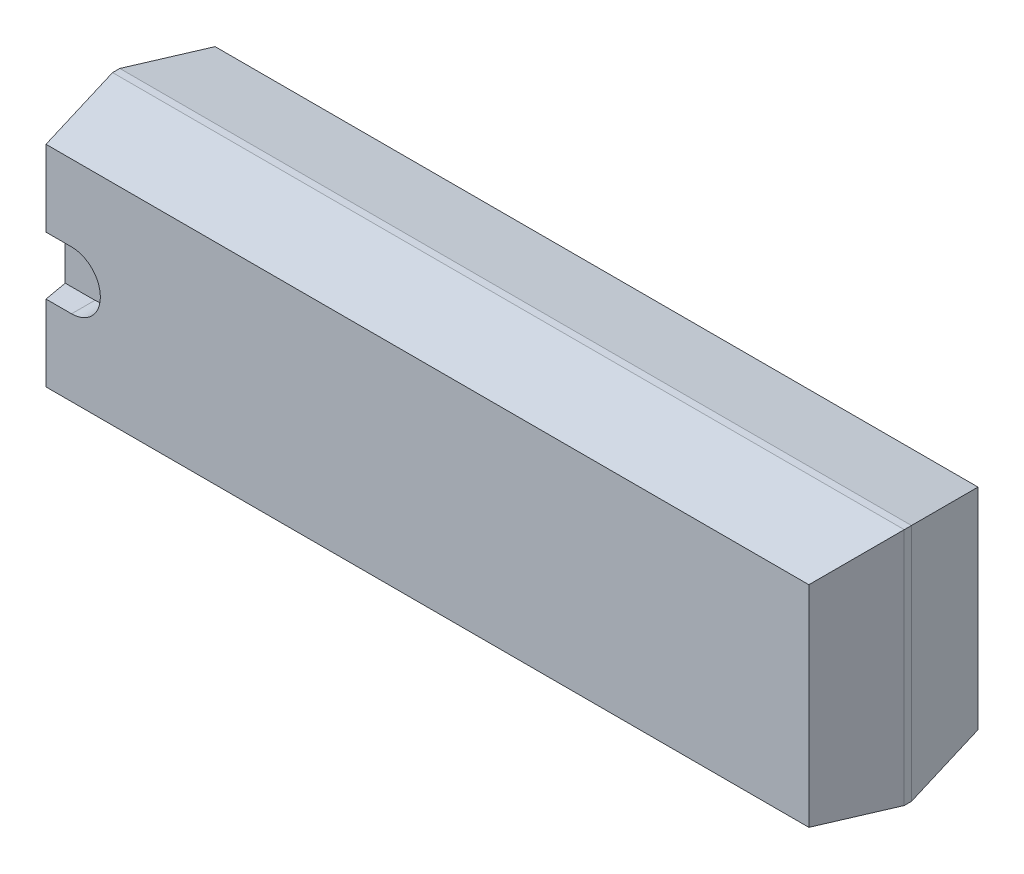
ISO-10303-21;
HEADER;
FILE_DESCRIPTION(('STEP AP214'),'2;1');
FILE_NAME('part.step','',(''),(''),'','','');
FILE_SCHEMA(('AUTOMOTIVE_DESIGN { 1 0 10303 214 1 1 1 1 }'));
ENDSEC;
DATA;
#1=APPLICATION_CONTEXT('core data for automotive mechanical design processes');
#2=APPLICATION_PROTOCOL_DEFINITION('international standard','automotive_design',2000,#1);
#3=PRODUCT_CONTEXT('',#1,'mechanical');
#4=PRODUCT('Part','Part','',(#3));
#5=PRODUCT_RELATED_PRODUCT_CATEGORY('part','',(#4));
#6=PRODUCT_DEFINITION_FORMATION('','',#4);
#7=PRODUCT_DEFINITION_CONTEXT('part definition',#1,'design');
#8=PRODUCT_DEFINITION('design','',#6,#7);
#9=PRODUCT_DEFINITION_SHAPE('','',#8);
#10=(LENGTH_UNIT() NAMED_UNIT(*) SI_UNIT(.MILLI.,.METRE.));
#11=(NAMED_UNIT(*) PLANE_ANGLE_UNIT() SI_UNIT($,.RADIAN.));
#12=(NAMED_UNIT(*) SI_UNIT($,.STERADIAN.) SOLID_ANGLE_UNIT());
#13=UNCERTAINTY_MEASURE_WITH_UNIT(LENGTH_MEASURE(1.E-05),#10,'distance_accuracy_value','');
#14=(GEOMETRIC_REPRESENTATION_CONTEXT(3) GLOBAL_UNCERTAINTY_ASSIGNED_CONTEXT((#13)) GLOBAL_UNIT_ASSIGNED_CONTEXT((#10,
#11,#12)) REPRESENTATION_CONTEXT('',''));
#15=CARTESIAN_POINT('',(0.,0.,0.));
#16=DIRECTION('',(0.,0.,1.));
#17=DIRECTION('',(1.,0.,0.));
#18=AXIS2_PLACEMENT_3D('',#15,#16,#17);
#19=CARTESIAN_POINT('',(-0.99999706,3.8050105,4.50000116));
#20=DIRECTION('',(0.,0.,1.));
#21=DIRECTION('',(1.,0.,0.));
#22=AXIS2_PLACEMENT_3D('',#19,#20,#21);
#23=CYLINDRICAL_SURFACE('',#22,0.8);
#24=CARTESIAN_POINT('',(-0.99999706,3.8050105,4.50000116));
#25=DIRECTION('',(0.,0.,1.));
#26=DIRECTION('',(1.,0.,0.));
#27=AXIS2_PLACEMENT_3D('',#24,#25,#26);
#28=CIRCLE('',#27,0.8);
#29=CARTESIAN_POINT('',(-0.19999706,3.8050105,4.50000116));
#30=VERTEX_POINT('',#29);
#31=CARTESIAN_POINT('',(-0.99999706,3.0050105,4.50000116));
#32=VERTEX_POINT('',#31);
#33=EDGE_CURVE('E142',#30,#32,#28,.F.);
#34=ORIENTED_EDGE('',*,*,#33,.T.);
#35=DIRECTION('',(0.,0.,1.));
#36=VECTOR('',#35,1.);
#37=CARTESIAN_POINT('',(-0.99999706,3.0050105,4.50000116));
#38=LINE('',#37,#36);
#39=CARTESIAN_POINT('',(-0.99999706,3.0050105,5.14999986));
#40=VERTEX_POINT('',#39);
#41=EDGE_CURVE('E126',#40,#32,#38,.F.);
#42=ORIENTED_EDGE('',*,*,#41,.F.);
#43=CARTESIAN_POINT('',(-0.99999706,3.8050105,5.14999986));
#44=DIRECTION('',(0.,0.,1.));
#45=DIRECTION('',(1.,0.,0.));
#46=AXIS2_PLACEMENT_3D('',#43,#44,#45);
#47=CIRCLE('',#46,0.8);
#48=CARTESIAN_POINT('',(-0.19999706,3.8050105,5.14999986));
#49=VERTEX_POINT('',#48);
#50=EDGE_CURVE('E158',#40,#49,#47,.T.);
#51=ORIENTED_EDGE('',*,*,#50,.T.);
#52=DIRECTION('',(0.,0.,1.));
#53=VECTOR('',#52,1.);
#54=CARTESIAN_POINT('',(-0.19999706,3.8050105,4.50000116));
#55=LINE('',#54,#53);
#56=EDGE_CURVE('E179',#30,#49,#55,.T.);
#57=ORIENTED_EDGE('',*,*,#56,.F.);
#58=EDGE_LOOP('',(#34,#42,#51,#57));
#59=FACE_BOUND('',#58,.T.);
#60=ADVANCED_FACE('F16',(#59),#23,.F.);
#61=CARTESIAN_POINT('',(-0.19999706,3.0050105,4.50000116));
#62=DIRECTION('',(-1.,0.,0.));
#63=DIRECTION('',(0.,0.,1.));
#64=AXIS2_PLACEMENT_3D('',#61,#62,#63);
#65=PLANE('',#64);
#66=DIRECTION('',(0.,0.,1.));
#67=VECTOR('',#66,1.);
#68=CARTESIAN_POINT('',(-0.19999706,3.81501236,4.50000116));
#69=LINE('',#68,#67);
#70=CARTESIAN_POINT('',(-0.19999706,3.81501236,5.14999986));
#71=VERTEX_POINT('',#70);
#72=CARTESIAN_POINT('',(-0.19999706,3.81501236,4.50000116));
#73=VERTEX_POINT('',#72);
#74=EDGE_CURVE('E177',#71,#73,#69,.F.);
#75=ORIENTED_EDGE('',*,*,#74,.T.);
#76=DIRECTION('',(0.,1.,0.));
#77=VECTOR('',#76,1.);
#78=CARTESIAN_POINT('',(-0.19999706,4.61501236,4.50000116));
#79=LINE('',#78,#77);
#80=EDGE_CURVE('E123',#73,#30,#79,.F.);
#81=ORIENTED_EDGE('',*,*,#80,.T.);
#82=ORIENTED_EDGE('',*,*,#56,.T.);
#83=DIRECTION('',(0.,1.,0.));
#84=VECTOR('',#83,1.);
#85=CARTESIAN_POINT('',(-0.19999706,7.13000606,5.14999986));
#86=LINE('',#85,#84);
#87=EDGE_CURVE('E157',#49,#71,#86,.T.);
#88=ORIENTED_EDGE('',*,*,#87,.T.);
#89=EDGE_LOOP('',(#75,#81,#82,#88));
#90=FACE_BOUND('',#89,.T.);
#91=ADVANCED_FACE('F224',(#90),#65,.T.);
#92=CARTESIAN_POINT('',(-0.99999706,3.81501236,4.50000116));
#93=DIRECTION('',(0.,0.,1.));
#94=DIRECTION('',(1.,0.,0.));
#95=AXIS2_PLACEMENT_3D('',#92,#93,#94);
#96=CYLINDRICAL_SURFACE('',#95,0.8);
#97=CARTESIAN_POINT('',(-0.99999706,3.81501236,4.50000116));
#98=DIRECTION('',(0.,0.,1.));
#99=DIRECTION('',(1.,0.,0.));
#100=AXIS2_PLACEMENT_3D('',#97,#98,#99);
#101=CIRCLE('',#100,0.8);
#102=CARTESIAN_POINT('',(-0.99999706,4.61501236,4.50000116));
#103=VERTEX_POINT('',#102);
#104=EDGE_CURVE('E19',#103,#73,#101,.F.);
#105=ORIENTED_EDGE('',*,*,#104,.T.);
#106=ORIENTED_EDGE('',*,*,#74,.F.);
#107=CARTESIAN_POINT('',(-0.99999706,3.81501236,5.14999986));
#108=DIRECTION('',(0.,0.,1.));
#109=DIRECTION('',(1.,0.,0.));
#110=AXIS2_PLACEMENT_3D('',#107,#108,#109);
#111=CIRCLE('',#110,0.8);
#112=CARTESIAN_POINT('',(-0.99999706,4.61501236,5.14999986));
#113=VERTEX_POINT('',#112);
#114=EDGE_CURVE('E131',#71,#113,#111,.T.);
#115=ORIENTED_EDGE('',*,*,#114,.T.);
#116=DIRECTION('',(0.,0.,-1.));
#117=VECTOR('',#116,1.);
#118=CARTESIAN_POINT('',(-0.99999706,4.61501236,4.50000116));
#119=LINE('',#118,#117);
#120=EDGE_CURVE('E128',#103,#113,#119,.F.);
#121=ORIENTED_EDGE('',*,*,#120,.F.);
#122=EDGE_LOOP('',(#105,#106,#115,#121));
#123=FACE_BOUND('',#122,.T.);
#124=ADVANCED_FACE('F129',(#123),#96,.F.);
#125=CARTESIAN_POINT('',(-2.40999772,3.0050105,4.50000116));
#126=DIRECTION('',(0.,1.,0.));
#127=DIRECTION('',(0.,0.,1.));
#128=AXIS2_PLACEMENT_3D('',#125,#126,#127);
#129=PLANE('',#128);
#130=ORIENTED_EDGE('',*,*,#41,.T.);
#131=DIRECTION('',(-1.,0.,0.));
#132=VECTOR('',#131,1.);
#133=CARTESIAN_POINT('',(-2.40999772,3.0050105,4.50000116));
#134=LINE('',#133,#132);
#135=CARTESIAN_POINT('',(-1.8255511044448,3.0050105,4.50000115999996));
#136=VERTEX_POINT('',#135);
#137=EDGE_CURVE('E140',#32,#136,#134,.T.);
#138=ORIENTED_EDGE('',*,*,#137,.T.);
#139=DIRECTION('',(0.175033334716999,0.,0.984562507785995));
#140=VECTOR('',#139,1.);
#141=CARTESIAN_POINT('',(-1.90999578,3.0050105,4.02499986));
#142=LINE('',#141,#140);
#143=CARTESIAN_POINT('',(-1.70999578,3.0050105,5.14999986));
#144=VERTEX_POINT('',#143);
#145=EDGE_CURVE('E152',#144,#136,#142,.F.);
#146=ORIENTED_EDGE('',*,*,#145,.F.);
#147=DIRECTION('',(-1.,0.,0.));
#148=VECTOR('',#147,1.);
#149=CARTESIAN_POINT('',(-2.10999578,3.0050105,5.14999986));
#150=LINE('',#149,#148);
#151=EDGE_CURVE('E134',#144,#40,#150,.F.);
#152=ORIENTED_EDGE('',*,*,#151,.T.);
#153=EDGE_LOOP('',(#130,#138,#146,#152));
#154=FACE_BOUND('',#153,.T.);
#155=ADVANCED_FACE('F218',(#154),#129,.T.);
#156=CARTESIAN_POINT('',(-2.40999772,4.61501236,4.50000116));
#157=DIRECTION('',(0.,0.,-1.));
#158=DIRECTION('',(-1.,0.,0.));
#159=AXIS2_PLACEMENT_3D('',#156,#157,#158);
#160=PLANE('',#159);
#161=ORIENTED_EDGE('',*,*,#33,.F.);
#162=ORIENTED_EDGE('',*,*,#80,.F.);
#163=ORIENTED_EDGE('',*,*,#104,.F.);
#164=DIRECTION('',(1.,0.,0.));
#165=VECTOR('',#164,1.);
#166=CARTESIAN_POINT('',(-0.19999706,4.61501236,4.50000116));
#167=LINE('',#166,#165);
#168=CARTESIAN_POINT('',(-1.82555110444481,4.61501236,4.50000115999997));
#169=VERTEX_POINT('',#168);
#170=EDGE_CURVE('E120',#169,#103,#167,.T.);
#171=ORIENTED_EDGE('',*,*,#170,.F.);
#172=DIRECTION('',(0.,1.,0.));
#173=VECTOR('',#172,1.);
#174=CARTESIAN_POINT('',(-1.8255511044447,6.73000606,4.50000115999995));
#175=LINE('',#174,#173);
#176=EDGE_CURVE('E150',#136,#169,#175,.T.);
#177=ORIENTED_EDGE('',*,*,#176,.F.);
#178=ORIENTED_EDGE('',*,*,#137,.F.);
#179=EDGE_LOOP('',(#161,#162,#163,#171,#177,#178));
#180=FACE_BOUND('',#179,.T.);
#181=ADVANCED_FACE('F117',(#180),#160,.F.);
#182=CARTESIAN_POINT('',(-0.19999706,4.61501236,4.50000116));
#183=DIRECTION('',(0.,-1.,0.));
#184=DIRECTION('',(0.,0.,-1.));
#185=AXIS2_PLACEMENT_3D('',#182,#183,#184);
#186=PLANE('',#185);
#187=ORIENTED_EDGE('',*,*,#120,.T.);
#188=DIRECTION('',(-1.,0.,0.));
#189=VECTOR('',#188,1.);
#190=CARTESIAN_POINT('',(-2.10999578,4.61501236,5.14999986));
#191=LINE('',#190,#189);
#192=CARTESIAN_POINT('',(-1.70999578,4.61501236,5.14999986));
#193=VERTEX_POINT('',#192);
#194=EDGE_CURVE('E156',#113,#193,#191,.T.);
#195=ORIENTED_EDGE('',*,*,#194,.T.);
#196=DIRECTION('',(0.175033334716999,0.,0.984562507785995));
#197=VECTOR('',#196,1.);
#198=CARTESIAN_POINT('',(-1.90999578,4.61501236,4.02499986));
#199=LINE('',#198,#197);
#200=EDGE_CURVE('E138',#169,#193,#199,.T.);
#201=ORIENTED_EDGE('',*,*,#200,.F.);
#202=ORIENTED_EDGE('',*,*,#170,.T.);
#203=EDGE_LOOP('',(#187,#195,#201,#202));
#204=FACE_BOUND('',#203,.T.);
#205=ADVANCED_FACE('F136',(#204),#186,.T.);
#206=CARTESIAN_POINT('',(-2.10999578,7.13000606,5.14999986));
#207=DIRECTION('',(0.,0.,-1.));
#208=DIRECTION('',(-1.,0.,0.));
#209=AXIS2_PLACEMENT_3D('',#206,#207,#208);
#210=PLANE('',#209);
#211=DIRECTION('',(0.,1.,0.));
#212=VECTOR('',#211,1.);
#213=CARTESIAN_POINT('',(19.4900059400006,0.8900041,5.1499998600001));
#214=LINE('',#213,#212);
#215=CARTESIAN_POINT('',(19.4900059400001,6.73000606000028,5.14999986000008));
#216=VERTEX_POINT('',#215);
#217=CARTESIAN_POINT('',(19.4900059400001,0.890004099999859,5.14999986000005));
#218=VERTEX_POINT('',#217);
#219=EDGE_CURVE('E196',#216,#218,#214,.F.);
#220=ORIENTED_EDGE('',*,*,#219,.F.);
#221=DIRECTION('',(1.,0.,0.));
#222=VECTOR('',#221,1.);
#223=CARTESIAN_POINT('',(19.89000594,6.73000606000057,5.1499998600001));
#224=LINE('',#223,#222);
#225=CARTESIAN_POINT('',(-1.70999578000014,6.73000606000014,5.14999986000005));
#226=VERTEX_POINT('',#225);
#227=EDGE_CURVE('E206',#226,#216,#224,.T.);
#228=ORIENTED_EDGE('',*,*,#227,.F.);
#229=DIRECTION('',(0.,1.,0.));
#230=VECTOR('',#229,1.);
#231=CARTESIAN_POINT('',(-1.70999578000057,6.73000606,5.1499998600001));
#232=LINE('',#231,#230);
#233=EDGE_CURVE('E168',#193,#226,#232,.T.);
#234=ORIENTED_EDGE('',*,*,#233,.F.);
#235=ORIENTED_EDGE('',*,*,#194,.F.);
#236=ORIENTED_EDGE('',*,*,#114,.F.);
#237=ORIENTED_EDGE('',*,*,#87,.F.);
#238=ORIENTED_EDGE('',*,*,#50,.F.);
#239=ORIENTED_EDGE('',*,*,#151,.F.);
#240=DIRECTION('',(0.,1.,0.));
#241=VECTOR('',#240,1.);
#242=CARTESIAN_POINT('',(-1.70999578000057,6.73000606,5.1499998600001));
#243=LINE('',#242,#241);
#244=CARTESIAN_POINT('',(-1.70999578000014,0.890004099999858,5.14999986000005));
#245=VERTEX_POINT('',#244);
#246=EDGE_CURVE('E184',#245,#144,#243,.T.);
#247=ORIENTED_EDGE('',*,*,#246,.F.);
#248=DIRECTION('',(1.,0.,0.));
#249=VECTOR('',#248,1.);
#250=CARTESIAN_POINT('',(-2.10999578,0.890004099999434,5.1499998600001));
#251=LINE('',#250,#249);
#252=EDGE_CURVE('E191',#218,#245,#251,.F.);
#253=ORIENTED_EDGE('',*,*,#252,.F.);
#254=EDGE_LOOP('',(#220,#228,#234,#235,#236,#237,#238,#239,#247,#253));
#255=FACE_BOUND('',#254,.T.);
#256=ADVANCED_FACE('F223',(#255),#210,.F.);
#257=CARTESIAN_POINT('',(19.89000594,6.93000606,4.02499986));
#258=DIRECTION('',(0.,0.984562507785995,0.175033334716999));
#259=DIRECTION('',(0.,-0.175033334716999,0.984562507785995));
#260=AXIS2_PLACEMENT_3D('',#257,#258,#259);
#261=PLANE('',#260);
#262=DIRECTION('',(-0.172412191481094,0.172412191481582,-0.969818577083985));
#263=VECTOR('',#262,1.);
#264=CARTESIAN_POINT('',(-1.70999578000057,6.73000606,5.1499998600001));
#265=LINE('',#264,#263);
#266=CARTESIAN_POINT('',(-2.10999577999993,7.13000605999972,2.89999985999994));
#267=VERTEX_POINT('',#266);
#268=EDGE_CURVE('E171',#226,#267,#265,.T.);
#269=ORIENTED_EDGE('',*,*,#268,.F.);
#270=ORIENTED_EDGE('',*,*,#227,.T.);
#271=DIRECTION('',(-0.172412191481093,-0.172412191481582,0.969818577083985));
#272=VECTOR('',#271,1.);
#273=CARTESIAN_POINT('',(19.8900059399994,7.13000606,2.8999998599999));
#274=LINE('',#273,#272);
#275=CARTESIAN_POINT('',(19.8900059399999,7.13000605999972,2.89999985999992));
#276=VERTEX_POINT('',#275);
#277=EDGE_CURVE('E203',#276,#216,#274,.T.);
#278=ORIENTED_EDGE('',*,*,#277,.F.);
#279=DIRECTION('',(1.,0.,0.));
#280=VECTOR('',#279,1.);
#281=CARTESIAN_POINT('',(19.89000594,7.13000606,2.89999986));
#282=LINE('',#281,#280);
#283=EDGE_CURVE('E293',#276,#267,#282,.F.);
#284=ORIENTED_EDGE('',*,*,#283,.T.);
#285=EDGE_LOOP('',(#269,#270,#278,#284));
#286=FACE_BOUND('',#285,.T.);
#287=ADVANCED_FACE('F341',(#286),#261,.T.);
#288=CARTESIAN_POINT('',(19.69000594,0.8900041,4.02499986));
#289=DIRECTION('',(0.984562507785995,0.,0.175033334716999));
#290=DIRECTION('',(0.175033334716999,0.,-0.984562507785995));
#291=AXIS2_PLACEMENT_3D('',#288,#289,#290);
#292=PLANE('',#291);
#293=ORIENTED_EDGE('',*,*,#219,.T.);
#294=DIRECTION('',(-0.172412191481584,0.172412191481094,0.969818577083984));
#295=VECTOR('',#294,1.);
#296=CARTESIAN_POINT('',(19.89000594,0.490004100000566,2.8999998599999));
#297=LINE('',#296,#295);
#298=CARTESIAN_POINT('',(19.8900059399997,0.490004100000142,2.89999985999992));
#299=VERTEX_POINT('',#298);
#300=EDGE_CURVE('E187',#299,#218,#297,.T.);
#301=ORIENTED_EDGE('',*,*,#300,.F.);
#302=DIRECTION('',(0.,1.,0.));
#303=VECTOR('',#302,1.);
#304=CARTESIAN_POINT('',(19.89000594,0.4900041,2.89999986));
#305=LINE('',#304,#303);
#306=EDGE_CURVE('E285',#299,#276,#305,.T.);
#307=ORIENTED_EDGE('',*,*,#306,.T.);
#308=ORIENTED_EDGE('',*,*,#277,.T.);
#309=EDGE_LOOP('',(#293,#301,#307,#308));
#310=FACE_BOUND('',#309,.T.);
#311=ADVANCED_FACE('F245',(#310),#292,.T.);
#312=CARTESIAN_POINT('',(-2.10999578,0.6900041,4.02499986));
#313=DIRECTION('',(0.,-0.984562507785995,0.175033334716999));
#314=DIRECTION('',(0.,-0.175033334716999,-0.984562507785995));
#315=AXIS2_PLACEMENT_3D('',#312,#313,#314);
#316=PLANE('',#315);
#317=DIRECTION('',(1.,0.,0.));
#318=VECTOR('',#317,1.);
#319=CARTESIAN_POINT('',(-2.10999578,0.4900041,2.89999986));
#320=LINE('',#319,#318);
#321=CARTESIAN_POINT('',(-2.10999577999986,0.490004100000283,2.89999985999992));
#322=VERTEX_POINT('',#321);
#323=EDGE_CURVE('E295',#322,#299,#320,.T.);
#324=ORIENTED_EDGE('',*,*,#323,.T.);
#325=ORIENTED_EDGE('',*,*,#300,.T.);
#326=ORIENTED_EDGE('',*,*,#252,.T.);
#327=DIRECTION('',(0.172412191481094,0.172412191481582,0.969818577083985));
#328=VECTOR('',#327,1.);
#329=CARTESIAN_POINT('',(-2.10999577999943,0.4900041,2.8999998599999));
#330=LINE('',#329,#328);
#331=EDGE_CURVE('E307',#322,#245,#330,.T.);
#332=ORIENTED_EDGE('',*,*,#331,.F.);
#333=EDGE_LOOP('',(#324,#325,#326,#332));
#334=FACE_BOUND('',#333,.T.);
#335=ADVANCED_FACE('F235',(#334),#316,.T.);
#336=CARTESIAN_POINT('',(-1.90999578,6.73000606,4.02499986));
#337=DIRECTION('',(-0.984562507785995,0.,0.175033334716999));
#338=DIRECTION('',(0.175033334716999,0.,0.984562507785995));
#339=AXIS2_PLACEMENT_3D('',#336,#337,#338);
#340=PLANE('',#339);
#341=DIRECTION('',(0.,1.,0.));
#342=VECTOR('',#341,1.);
#343=CARTESIAN_POINT('',(-2.10999578,7.13000606,2.89999986));
#344=LINE('',#343,#342);
#345=EDGE_CURVE('E231',#267,#322,#344,.F.);
#346=ORIENTED_EDGE('',*,*,#345,.T.);
#347=ORIENTED_EDGE('',*,*,#331,.T.);
#348=ORIENTED_EDGE('',*,*,#246,.T.);
#349=ORIENTED_EDGE('',*,*,#145,.T.);
#350=ORIENTED_EDGE('',*,*,#176,.T.);
#351=ORIENTED_EDGE('',*,*,#200,.T.);
#352=ORIENTED_EDGE('',*,*,#233,.T.);
#353=ORIENTED_EDGE('',*,*,#268,.T.);
#354=EDGE_LOOP('',(#346,#347,#348,#349,#350,#351,#352,#353));
#355=FACE_BOUND('',#354,.T.);
#356=ADVANCED_FACE('F229',(#355),#340,.T.);
#357=CARTESIAN_POINT('',(19.89000594,7.13000606,0.4499991));
#358=DIRECTION('',(0.,-1.,0.));
#359=DIRECTION('',(0.,0.,-1.));
#360=AXIS2_PLACEMENT_3D('',#357,#358,#359);
#361=PLANE('',#360);
#362=DIRECTION('',(0.,0.,-1.));
#363=VECTOR('',#362,1.);
#364=CARTESIAN_POINT('',(-2.10999578,7.13000606,0.4499991));
#365=LINE('',#364,#363);
#366=CARTESIAN_POINT('',(-2.10999577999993,7.13000605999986,2.69999910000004));
#367=VERTEX_POINT('',#366);
#368=EDGE_CURVE('E299',#367,#267,#365,.F.);
#369=ORIENTED_EDGE('',*,*,#368,.T.);
#370=ORIENTED_EDGE('',*,*,#283,.F.);
#371=DIRECTION('',(0.,0.,1.));
#372=VECTOR('',#371,1.);
#373=CARTESIAN_POINT('',(19.89000594,7.13000606,0.4499991));
#374=LINE('',#373,#372);
#375=CARTESIAN_POINT('',(19.8900059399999,7.13000605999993,2.69999910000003));
#376=VERTEX_POINT('',#375);
#377=EDGE_CURVE('E290',#276,#376,#374,.F.);
#378=ORIENTED_EDGE('',*,*,#377,.T.);
#379=DIRECTION('',(1.,0.,0.));
#380=VECTOR('',#379,1.);
#381=CARTESIAN_POINT('',(19.89000594,7.13000605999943,2.6999991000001));
#382=LINE('',#381,#380);
#383=EDGE_CURVE('E313',#376,#367,#382,.F.);
#384=ORIENTED_EDGE('',*,*,#383,.T.);
#385=EDGE_LOOP('',(#369,#370,#378,#384));
#386=FACE_BOUND('',#385,.T.);
#387=ADVANCED_FACE('F234',(#386),#361,.F.);
#388=CARTESIAN_POINT('',(19.89000594,0.4900041,0.4499991));
#389=DIRECTION('',(-1.,0.,0.));
#390=DIRECTION('',(0.,0.,1.));
#391=AXIS2_PLACEMENT_3D('',#388,#389,#390);
#392=PLANE('',#391);
#393=ORIENTED_EDGE('',*,*,#306,.F.);
#394=DIRECTION('',(0.,0.,1.));
#395=VECTOR('',#394,1.);
#396=CARTESIAN_POINT('',(19.89000594,0.4900041,0.4499991));
#397=LINE('',#396,#395);
#398=CARTESIAN_POINT('',(19.8900059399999,0.490004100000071,2.69999910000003));
#399=VERTEX_POINT('',#398);
#400=EDGE_CURVE('E288',#299,#399,#397,.F.);
#401=ORIENTED_EDGE('',*,*,#400,.T.);
#402=DIRECTION('',(0.,1.,0.));
#403=VECTOR('',#402,1.);
#404=CARTESIAN_POINT('',(19.8900059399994,0.8900041,2.6999991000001));
#405=LINE('',#404,#403);
#406=EDGE_CURVE('E317',#399,#376,#405,.T.);
#407=ORIENTED_EDGE('',*,*,#406,.T.);
#408=ORIENTED_EDGE('',*,*,#377,.F.);
#409=EDGE_LOOP('',(#393,#401,#407,#408));
#410=FACE_BOUND('',#409,.T.);
#411=ADVANCED_FACE('F242',(#410),#392,.F.);
#412=CARTESIAN_POINT('',(-2.10999578,0.4900041,0.4499991));
#413=DIRECTION('',(0.,1.,0.));
#414=DIRECTION('',(0.,0.,1.));
#415=AXIS2_PLACEMENT_3D('',#412,#413,#414);
#416=PLANE('',#415);
#417=ORIENTED_EDGE('',*,*,#400,.F.);
#418=ORIENTED_EDGE('',*,*,#323,.F.);
#419=DIRECTION('',(0.,0.,-1.));
#420=VECTOR('',#419,1.);
#421=CARTESIAN_POINT('',(-2.10999578,0.4900041,0.4499991));
#422=LINE('',#421,#420);
#423=CARTESIAN_POINT('',(-2.10999577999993,0.490004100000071,2.69999910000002));
#424=VERTEX_POINT('',#423);
#425=EDGE_CURVE('E312',#322,#424,#422,.T.);
#426=ORIENTED_EDGE('',*,*,#425,.T.);
#427=DIRECTION('',(1.,0.,0.));
#428=VECTOR('',#427,1.);
#429=CARTESIAN_POINT('',(-2.10999578,0.490004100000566,2.6999991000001));
#430=LINE('',#429,#428);
#431=EDGE_CURVE('E297',#424,#399,#430,.T.);
#432=ORIENTED_EDGE('',*,*,#431,.T.);
#433=EDGE_LOOP('',(#417,#418,#426,#432));
#434=FACE_BOUND('',#433,.T.);
#435=ADVANCED_FACE('F273',(#434),#416,.F.);
#436=CARTESIAN_POINT('',(-2.10999578,7.13000606,0.4499991));
#437=DIRECTION('',(1.,0.,0.));
#438=DIRECTION('',(0.,0.,-1.));
#439=AXIS2_PLACEMENT_3D('',#436,#437,#438);
#440=PLANE('',#439);
#441=ORIENTED_EDGE('',*,*,#345,.F.);
#442=ORIENTED_EDGE('',*,*,#368,.F.);
#443=DIRECTION('',(0.,1.,0.));
#444=VECTOR('',#443,1.);
#445=CARTESIAN_POINT('',(-2.10999577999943,6.73000606,2.6999991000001));
#446=LINE('',#445,#444);
#447=EDGE_CURVE('E327',#367,#424,#446,.F.);
#448=ORIENTED_EDGE('',*,*,#447,.T.);
#449=ORIENTED_EDGE('',*,*,#425,.F.);
#450=EDGE_LOOP('',(#441,#442,#448,#449));
#451=FACE_BOUND('',#450,.T.);
#452=ADVANCED_FACE('F269',(#451),#440,.F.);
#453=CARTESIAN_POINT('',(19.89000594,6.93000606,1.5749991));
#454=DIRECTION('',(0.,-0.984562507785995,0.175033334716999));
#455=DIRECTION('',(0.,-0.175033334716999,-0.984562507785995));
#456=AXIS2_PLACEMENT_3D('',#453,#454,#455);
#457=PLANE('',#456);
#458=ORIENTED_EDGE('',*,*,#383,.F.);
#459=DIRECTION('',(-0.172412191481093,-0.172412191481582,-0.969818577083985));
#460=VECTOR('',#459,1.);
#461=CARTESIAN_POINT('',(19.8900059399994,7.13000606,2.6999991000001));
#462=LINE('',#461,#460);
#463=CARTESIAN_POINT('',(19.4900059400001,6.73000606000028,0.449999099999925));
#464=VERTEX_POINT('',#463);
#465=EDGE_CURVE('E319',#376,#464,#462,.T.);
#466=ORIENTED_EDGE('',*,*,#465,.T.);
#467=DIRECTION('',(-1.,0.,0.));
#468=VECTOR('',#467,1.);
#469=CARTESIAN_POINT('',(-2.10999578,6.73000606,0.4499991));
#470=LINE('',#469,#468);
#471=CARTESIAN_POINT('',(-1.70999578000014,6.73000606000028,0.449999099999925));
#472=VERTEX_POINT('',#471);
#473=EDGE_CURVE('E330',#472,#464,#470,.F.);
#474=ORIENTED_EDGE('',*,*,#473,.F.);
#475=DIRECTION('',(-0.172412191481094,0.172412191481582,0.969818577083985));
#476=VECTOR('',#475,1.);
#477=CARTESIAN_POINT('',(-1.70999578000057,6.73000606,0.4499990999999));
#478=LINE('',#477,#476);
#479=EDGE_CURVE('E324',#472,#367,#478,.T.);
#480=ORIENTED_EDGE('',*,*,#479,.T.);
#481=EDGE_LOOP('',(#458,#466,#474,#480));
#482=FACE_BOUND('',#481,.T.);
#483=ADVANCED_FACE('F265',(#482),#457,.F.);
#484=CARTESIAN_POINT('',(19.69000594,0.8900041,1.5749991));
#485=DIRECTION('',(-0.984562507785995,0.,0.175033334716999));
#486=DIRECTION('',(0.175033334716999,0.,0.984562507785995));
#487=AXIS2_PLACEMENT_3D('',#484,#485,#486);
#488=PLANE('',#487);
#489=DIRECTION('',(0.,1.,0.));
#490=VECTOR('',#489,1.);
#491=CARTESIAN_POINT('',(19.49000594,7.13000606,0.4499991));
#492=LINE('',#491,#490);
#493=CARTESIAN_POINT('',(19.4900059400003,0.890004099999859,0.449999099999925));
#494=VERTEX_POINT('',#493);
#495=EDGE_CURVE('E333',#464,#494,#492,.F.);
#496=ORIENTED_EDGE('',*,*,#495,.F.);
#497=ORIENTED_EDGE('',*,*,#465,.F.);
#498=ORIENTED_EDGE('',*,*,#406,.F.);
#499=DIRECTION('',(-0.172412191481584,0.172412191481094,-0.969818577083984));
#500=VECTOR('',#499,1.);
#501=CARTESIAN_POINT('',(19.89000594,0.490004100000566,2.6999991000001));
#502=LINE('',#501,#500);
#503=EDGE_CURVE('E322',#399,#494,#502,.T.);
#504=ORIENTED_EDGE('',*,*,#503,.T.);
#505=EDGE_LOOP('',(#496,#497,#498,#504));
#506=FACE_BOUND('',#505,.T.);
#507=ADVANCED_FACE('F262',(#506),#488,.F.);
#508=CARTESIAN_POINT('',(-2.10999578,0.6900041,1.5749991));
#509=DIRECTION('',(0.,0.984562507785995,0.175033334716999));
#510=DIRECTION('',(0.,-0.175033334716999,0.984562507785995));
#511=AXIS2_PLACEMENT_3D('',#508,#509,#510);
#512=PLANE('',#511);
#513=ORIENTED_EDGE('',*,*,#431,.F.);
#514=DIRECTION('',(0.172412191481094,0.172412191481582,-0.969818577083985));
#515=VECTOR('',#514,1.);
#516=CARTESIAN_POINT('',(-2.10999577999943,0.4900041,2.6999991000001));
#517=LINE('',#516,#515);
#518=CARTESIAN_POINT('',(-1.70999578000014,0.890004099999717,0.449999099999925));
#519=VERTEX_POINT('',#518);
#520=EDGE_CURVE('E34',#424,#519,#517,.T.);
#521=ORIENTED_EDGE('',*,*,#520,.T.);
#522=DIRECTION('',(-1.,0.,0.));
#523=VECTOR('',#522,1.);
#524=CARTESIAN_POINT('',(-2.10999578,0.8900041,0.4499991));
#525=LINE('',#524,#523);
#526=EDGE_CURVE('E25',#494,#519,#525,.T.);
#527=ORIENTED_EDGE('',*,*,#526,.F.);
#528=ORIENTED_EDGE('',*,*,#503,.F.);
#529=EDGE_LOOP('',(#513,#521,#527,#528));
#530=FACE_BOUND('',#529,.T.);
#531=ADVANCED_FACE('F255',(#530),#512,.F.);
#532=CARTESIAN_POINT('',(-1.90999578,6.73000606,1.5749991));
#533=DIRECTION('',(0.984562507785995,0.,0.175033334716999));
#534=DIRECTION('',(0.175033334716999,0.,-0.984562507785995));
#535=AXIS2_PLACEMENT_3D('',#532,#533,#534);
#536=PLANE('',#535);
#537=ORIENTED_EDGE('',*,*,#520,.F.);
#538=ORIENTED_EDGE('',*,*,#447,.F.);
#539=ORIENTED_EDGE('',*,*,#479,.F.);
#540=DIRECTION('',(0.,1.,0.));
#541=VECTOR('',#540,1.);
#542=CARTESIAN_POINT('',(-1.70999578,7.13000606,0.4499991));
#543=LINE('',#542,#541);
#544=EDGE_CURVE('E10',#519,#472,#543,.T.);
#545=ORIENTED_EDGE('',*,*,#544,.F.);
#546=EDGE_LOOP('',(#537,#538,#539,#545));
#547=FACE_BOUND('',#546,.T.);
#548=ADVANCED_FACE('F249',(#547),#536,.F.);
#549=CARTESIAN_POINT('',(-2.10999578,7.13000606,0.4499991));
#550=DIRECTION('',(0.,0.,-1.));
#551=DIRECTION('',(-1.,0.,0.));
#552=AXIS2_PLACEMENT_3D('',#549,#550,#551);
#553=PLANE('',#552);
#554=ORIENTED_EDGE('',*,*,#526,.T.);
#555=ORIENTED_EDGE('',*,*,#544,.T.);
#556=ORIENTED_EDGE('',*,*,#473,.T.);
#557=ORIENTED_EDGE('',*,*,#495,.T.);
#558=EDGE_LOOP('',(#554,#555,#556,#557));
#559=FACE_BOUND('',#558,.T.);
#560=ADVANCED_FACE('F247',(#559),#553,.T.);
#561=CLOSED_SHELL('',(#60,#91,#124,#155,#181,#205,#256,#287,#311,#335,#356,#387,#411,#435,#452,
#483,#507,#531,#548,#560));
#562=MANIFOLD_SOLID_BREP('B1',#561);
#563=ADVANCED_BREP_SHAPE_REPRESENTATION('',(#18,#562),#14);
#564=SHAPE_DEFINITION_REPRESENTATION(#9,#563);
ENDSEC;
END-ISO-10303-21;
